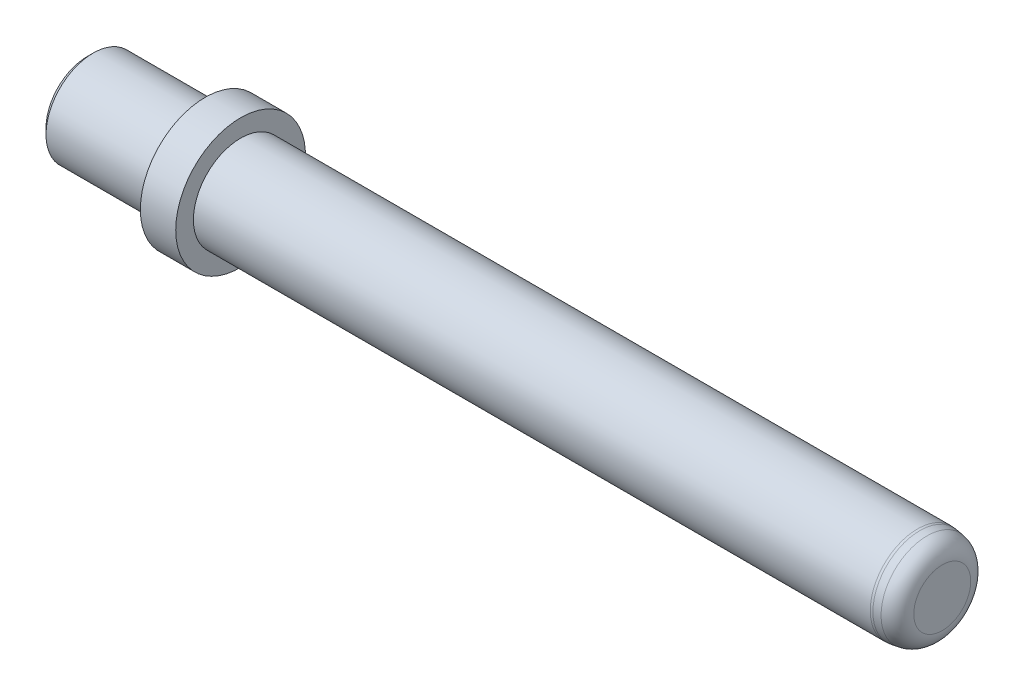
ISO-10303-21;
HEADER;
FILE_DESCRIPTION(('STEP AP214'),'2;1');
FILE_NAME('part.step','',(''),(''),'','','');
FILE_SCHEMA(('AUTOMOTIVE_DESIGN { 1 0 10303 214 1 1 1 1 }'));
ENDSEC;
DATA;
#1=APPLICATION_CONTEXT('core data for automotive mechanical design processes');
#2=APPLICATION_PROTOCOL_DEFINITION('international standard','automotive_design',2000,#1);
#3=PRODUCT_CONTEXT('',#1,'mechanical');
#4=PRODUCT('Part','Part','',(#3));
#5=PRODUCT_RELATED_PRODUCT_CATEGORY('part','',(#4));
#6=PRODUCT_DEFINITION_FORMATION('','',#4);
#7=PRODUCT_DEFINITION_CONTEXT('part definition',#1,'design');
#8=PRODUCT_DEFINITION('design','',#6,#7);
#9=PRODUCT_DEFINITION_SHAPE('','',#8);
#10=(LENGTH_UNIT() NAMED_UNIT(*) SI_UNIT(.MILLI.,.METRE.));
#11=(NAMED_UNIT(*) PLANE_ANGLE_UNIT() SI_UNIT($,.RADIAN.));
#12=(NAMED_UNIT(*) SI_UNIT($,.STERADIAN.) SOLID_ANGLE_UNIT());
#13=UNCERTAINTY_MEASURE_WITH_UNIT(LENGTH_MEASURE(1.E-05),#10,'distance_accuracy_value','');
#14=(GEOMETRIC_REPRESENTATION_CONTEXT(3) GLOBAL_UNCERTAINTY_ASSIGNED_CONTEXT((#13)) GLOBAL_UNIT_ASSIGNED_CONTEXT((#10,
#11,#12)) REPRESENTATION_CONTEXT('',''));
#15=CARTESIAN_POINT('',(0.,0.,0.));
#16=DIRECTION('',(0.,0.,1.));
#17=DIRECTION('',(1.,0.,0.));
#18=AXIS2_PLACEMENT_3D('',#15,#16,#17);
#19=CARTESIAN_POINT('',(4.,0.,0.));
#20=DIRECTION('',(-1.,0.,0.));
#21=DIRECTION('',(0.,0.,1.));
#22=AXIS2_PLACEMENT_3D('',#19,#20,#21);
#23=CONICAL_SURFACE('',#22,3.4,1.02974425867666);
#24=CARTESIAN_POINT('',(6.0429261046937,0.,0.));
#25=VERTEX_POINT('',#24);
#26=VERTEX_LOOP('',#25);
#27=FACE_BOUND('',#26,.T.);
#28=CARTESIAN_POINT('',(4.,0.,0.));
#29=DIRECTION('',(-1.,0.,0.));
#30=DIRECTION('',(0.,0.,1.));
#31=AXIS2_PLACEMENT_3D('',#28,#29,#30);
#32=CIRCLE('',#31,3.4);
#33=CARTESIAN_POINT('',(4.,0.,3.4));
#34=VERTEX_POINT('',#33);
#35=EDGE_CURVE('E11',#34,#34,#32,.T.);
#36=ORIENTED_EDGE('',*,*,#35,.T.);
#37=EDGE_LOOP('',(#36));
#38=FACE_BOUND('',#37,.T.);
#39=ADVANCED_FACE('F36',(#27,#38),#23,.F.);
#40=CARTESIAN_POINT('',(125.,0.,0.));
#41=DIRECTION('',(-1.,0.,0.));
#42=DIRECTION('',(0.,0.,1.));
#43=AXIS2_PLACEMENT_3D('',#40,#41,#42);
#44=CYLINDRICAL_SURFACE('',#43,3.4);
#45=ORIENTED_EDGE('',*,*,#35,.F.);
#46=EDGE_LOOP('',(#45));
#47=FACE_BOUND('',#46,.T.);
#48=CARTESIAN_POINT('',(0.,0.,0.));
#49=DIRECTION('',(-1.,0.,0.));
#50=DIRECTION('',(0.,0.,1.));
#51=AXIS2_PLACEMENT_3D('',#48,#49,#50);
#52=CIRCLE('',#51,3.4);
#53=CARTESIAN_POINT('',(0.,0.,3.4));
#54=VERTEX_POINT('',#53);
#55=EDGE_CURVE('E42',#54,#54,#52,.T.);
#56=ORIENTED_EDGE('',*,*,#55,.T.);
#57=EDGE_LOOP('',(#56));
#58=FACE_BOUND('',#57,.T.);
#59=ADVANCED_FACE('F47',(#47,#58),#44,.F.);
#60=CARTESIAN_POINT('',(0.,3.4,0.));
#61=DIRECTION('',(1.,0.,0.));
#62=DIRECTION('',(0.,0.,-1.));
#63=AXIS2_PLACEMENT_3D('',#60,#61,#62);
#64=PLANE('',#63);
#65=ORIENTED_EDGE('',*,*,#55,.F.);
#66=EDGE_LOOP('',(#65));
#67=FACE_BOUND('',#66,.T.);
#68=CARTESIAN_POINT('',(0.,0.,0.));
#69=DIRECTION('',(-1.,0.,0.));
#70=DIRECTION('',(0.,0.,1.));
#71=AXIS2_PLACEMENT_3D('',#68,#69,#70);
#72=CIRCLE('',#71,4.);
#73=CARTESIAN_POINT('',(0.,0.,4.));
#74=VERTEX_POINT('',#73);
#75=EDGE_CURVE('E56',#74,#74,#72,.T.);
#76=ORIENTED_EDGE('',*,*,#75,.T.);
#77=EDGE_LOOP('',(#76));
#78=FACE_BOUND('',#77,.T.);
#79=ADVANCED_FACE('F52',(#67,#78),#64,.F.);
#80=CARTESIAN_POINT('',(125.,0.,0.));
#81=DIRECTION('',(-1.,0.,0.));
#82=DIRECTION('',(0.,0.,1.));
#83=AXIS2_PLACEMENT_3D('',#80,#81,#82);
#84=CYLINDRICAL_SURFACE('',#83,4.);
#85=ORIENTED_EDGE('',*,*,#75,.F.);
#86=EDGE_LOOP('',(#85));
#87=FACE_BOUND('',#86,.T.);
#88=CARTESIAN_POINT('',(-20.,0.,0.));
#89=DIRECTION('',(-1.,0.,0.));
#90=DIRECTION('',(0.,0.,1.));
#91=AXIS2_PLACEMENT_3D('',#88,#89,#90);
#92=CIRCLE('',#91,4.);
#93=CARTESIAN_POINT('',(-20.,0.,4.));
#94=VERTEX_POINT('',#93);
#95=EDGE_CURVE('E58',#94,#94,#92,.T.);
#96=ORIENTED_EDGE('',*,*,#95,.T.);
#97=EDGE_LOOP('',(#96));
#98=FACE_BOUND('',#97,.T.);
#99=ADVANCED_FACE('F140',(#87,#98),#84,.F.);
#100=CARTESIAN_POINT('',(-20.,4.,0.));
#101=DIRECTION('',(1.,0.,0.));
#102=DIRECTION('',(0.,0.,-1.));
#103=AXIS2_PLACEMENT_3D('',#100,#101,#102);
#104=PLANE('',#103);
#105=ORIENTED_EDGE('',*,*,#95,.F.);
#106=EDGE_LOOP('',(#105));
#107=FACE_BOUND('',#106,.T.);
#108=CARTESIAN_POINT('',(-20.,0.,0.));
#109=DIRECTION('',(-1.,0.,0.));
#110=DIRECTION('',(0.,0.,1.));
#111=AXIS2_PLACEMENT_3D('',#108,#109,#110);
#112=CIRCLE('',#111,7.);
#113=CARTESIAN_POINT('',(-20.,0.,7.));
#114=VERTEX_POINT('',#113);
#115=EDGE_CURVE('E63',#114,#114,#112,.T.);
#116=ORIENTED_EDGE('',*,*,#115,.T.);
#117=EDGE_LOOP('',(#116));
#118=FACE_BOUND('',#117,.T.);
#119=ADVANCED_FACE('F136',(#107,#118),#104,.F.);
#120=CARTESIAN_POINT('',(-19.,0.,0.));
#121=DIRECTION('',(1.,0.,0.));
#122=DIRECTION('',(0.,0.,-1.));
#123=AXIS2_PLACEMENT_3D('',#120,#121,#122);
#124=CONICAL_SURFACE('',#123,8.,0.785398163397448);
#125=ORIENTED_EDGE('',*,*,#115,.F.);
#126=EDGE_LOOP('',(#125));
#127=FACE_BOUND('',#126,.T.);
#128=CARTESIAN_POINT('',(-19.,0.,0.));
#129=DIRECTION('',(-1.,0.,0.));
#130=DIRECTION('',(0.,0.,1.));
#131=AXIS2_PLACEMENT_3D('',#128,#129,#130);
#132=CIRCLE('',#131,8.);
#133=CARTESIAN_POINT('',(-19.,0.,8.));
#134=VERTEX_POINT('',#133);
#135=EDGE_CURVE('E66',#134,#134,#132,.T.);
#136=ORIENTED_EDGE('',*,*,#135,.T.);
#137=EDGE_LOOP('',(#136));
#138=FACE_BOUND('',#137,.T.);
#139=ADVANCED_FACE('F132',(#127,#138),#124,.T.);
#140=CARTESIAN_POINT('',(125.,0.,0.));
#141=DIRECTION('',(-1.,0.,0.));
#142=DIRECTION('',(0.,0.,1.));
#143=AXIS2_PLACEMENT_3D('',#140,#141,#142);
#144=CYLINDRICAL_SURFACE('',#143,8.);
#145=ORIENTED_EDGE('',*,*,#135,.F.);
#146=EDGE_LOOP('',(#145));
#147=FACE_BOUND('',#146,.T.);
#148=CARTESIAN_POINT('',(0.,0.,0.));
#149=DIRECTION('',(-1.,0.,0.));
#150=DIRECTION('',(0.,0.,1.));
#151=AXIS2_PLACEMENT_3D('',#148,#149,#150);
#152=CIRCLE('',#151,8.);
#153=CARTESIAN_POINT('',(0.,0.,8.));
#154=VERTEX_POINT('',#153);
#155=EDGE_CURVE('E69',#154,#154,#152,.T.);
#156=ORIENTED_EDGE('',*,*,#155,.T.);
#157=EDGE_LOOP('',(#156));
#158=FACE_BOUND('',#157,.T.);
#159=ADVANCED_FACE('F128',(#147,#158),#144,.T.);
#160=CARTESIAN_POINT('',(0.,8.,0.));
#161=DIRECTION('',(1.,0.,0.));
#162=DIRECTION('',(0.,0.,-1.));
#163=AXIS2_PLACEMENT_3D('',#160,#161,#162);
#164=PLANE('',#163);
#165=ORIENTED_EDGE('',*,*,#155,.F.);
#166=EDGE_LOOP('',(#165));
#167=FACE_BOUND('',#166,.T.);
#168=CARTESIAN_POINT('',(0.,0.,0.));
#169=DIRECTION('',(-1.,0.,0.));
#170=DIRECTION('',(0.,0.,1.));
#171=AXIS2_PLACEMENT_3D('',#168,#169,#170);
#172=CIRCLE('',#171,11.);
#173=CARTESIAN_POINT('',(0.,0.,11.));
#174=VERTEX_POINT('',#173);
#175=EDGE_CURVE('E72',#174,#174,#172,.T.);
#176=ORIENTED_EDGE('',*,*,#175,.T.);
#177=EDGE_LOOP('',(#176));
#178=FACE_BOUND('',#177,.T.);
#179=ADVANCED_FACE('F124',(#167,#178),#164,.F.);
#180=CARTESIAN_POINT('',(125.,0.,0.));
#181=DIRECTION('',(-1.,0.,0.));
#182=DIRECTION('',(0.,0.,1.));
#183=AXIS2_PLACEMENT_3D('',#180,#181,#182);
#184=CYLINDRICAL_SURFACE('',#183,11.);
#185=ORIENTED_EDGE('',*,*,#175,.F.);
#186=EDGE_LOOP('',(#185));
#187=FACE_BOUND('',#186,.T.);
#188=CARTESIAN_POINT('',(6.00000000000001,0.,0.));
#189=DIRECTION('',(-1.,0.,0.));
#190=DIRECTION('',(0.,0.,1.));
#191=AXIS2_PLACEMENT_3D('',#188,#189,#190);
#192=CIRCLE('',#191,11.);
#193=CARTESIAN_POINT('',(6.00000000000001,0.,11.));
#194=VERTEX_POINT('',#193);
#195=EDGE_CURVE('E75',#194,#194,#192,.T.);
#196=ORIENTED_EDGE('',*,*,#195,.T.);
#197=EDGE_LOOP('',(#196));
#198=FACE_BOUND('',#197,.T.);
#199=ADVANCED_FACE('F120',(#187,#198),#184,.T.);
#200=CARTESIAN_POINT('',(6.,11.,0.));
#201=DIRECTION('',(-1.,0.,0.));
#202=DIRECTION('',(0.,0.,1.));
#203=AXIS2_PLACEMENT_3D('',#200,#201,#202);
#204=PLANE('',#203);
#205=ORIENTED_EDGE('',*,*,#195,.F.);
#206=EDGE_LOOP('',(#205));
#207=FACE_BOUND('',#206,.T.);
#208=CARTESIAN_POINT('',(6.00000000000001,0.,0.));
#209=DIRECTION('',(-1.,0.,0.));
#210=DIRECTION('',(0.,0.,1.));
#211=AXIS2_PLACEMENT_3D('',#208,#209,#210);
#212=CIRCLE('',#211,8.);
#213=CARTESIAN_POINT('',(6.00000000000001,0.,8.));
#214=VERTEX_POINT('',#213);
#215=EDGE_CURVE('E78',#214,#214,#212,.T.);
#216=ORIENTED_EDGE('',*,*,#215,.T.);
#217=EDGE_LOOP('',(#216));
#218=FACE_BOUND('',#217,.T.);
#219=ADVANCED_FACE('F116',(#207,#218),#204,.F.);
#220=CARTESIAN_POINT('',(125.,0.,0.));
#221=DIRECTION('',(-1.,0.,0.));
#222=DIRECTION('',(0.,0.,1.));
#223=AXIS2_PLACEMENT_3D('',#220,#221,#222);
#224=CYLINDRICAL_SURFACE('',#223,8.);
#225=ORIENTED_EDGE('',*,*,#215,.F.);
#226=EDGE_LOOP('',(#225));
#227=FACE_BOUND('',#226,.T.);
#228=CARTESIAN_POINT('',(120.79021956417,0.,0.));
#229=DIRECTION('',(-1.,0.,0.));
#230=DIRECTION('',(0.,0.,1.));
#231=AXIS2_PLACEMENT_3D('',#228,#229,#230);
#232=CIRCLE('',#231,8.);
#233=CARTESIAN_POINT('',(120.79021956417,0.,8.));
#234=VERTEX_POINT('',#233);
#235=EDGE_CURVE('E81',#234,#234,#232,.T.);
#236=ORIENTED_EDGE('',*,*,#235,.T.);
#237=EDGE_LOOP('',(#236));
#238=FACE_BOUND('',#237,.T.);
#239=ADVANCED_FACE('F112',(#227,#238),#224,.T.);
#240=CARTESIAN_POINT('',(120.790219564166,0.,0.));
#241=DIRECTION('',(-1.,0.,0.));
#242=DIRECTION('',(0.,0.,1.));
#243=AXIS2_PLACEMENT_3D('',#240,#241,#242);
#244=TOROIDAL_SURFACE('',#243,4.99999999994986,3.00000000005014);
#245=ORIENTED_EDGE('',*,*,#235,.F.);
#246=EDGE_LOOP('',(#245));
#247=FACE_BOUND('',#246,.T.);
#248=CARTESIAN_POINT('',(121.20773886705,0.,0.));
#249=DIRECTION('',(-1.,0.,0.));
#250=DIRECTION('',(0.,0.,1.));
#251=AXIS2_PLACEMENT_3D('',#248,#249,#250);
#252=CIRCLE('',#251,7.9708042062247);
#253=CARTESIAN_POINT('',(121.20773886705,0.,7.9708042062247));
#254=VERTEX_POINT('',#253);
#255=EDGE_CURVE('E84',#254,#254,#252,.T.);
#256=ORIENTED_EDGE('',*,*,#255,.T.);
#257=EDGE_LOOP('',(#256));
#258=FACE_BOUND('',#257,.T.);
#259=ADVANCED_FACE('F108',(#247,#258),#244,.T.);
#260=CARTESIAN_POINT('',(122.41751930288,0.,0.));
#261=DIRECTION('',(-1.,0.,0.));
#262=DIRECTION('',(0.,0.,1.));
#263=AXIS2_PLACEMENT_3D('',#260,#261,#262);
#264=CONICAL_SURFACE('',#263,7.8007806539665,0.139626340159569);
#265=ORIENTED_EDGE('',*,*,#255,.F.);
#266=EDGE_LOOP('',(#265));
#267=FACE_BOUND('',#266,.T.);
#268=CARTESIAN_POINT('',(122.41751930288,0.,0.));
#269=DIRECTION('',(-1.,0.,0.));
#270=DIRECTION('',(0.,0.,1.));
#271=AXIS2_PLACEMENT_3D('',#268,#269,#270);
#272=CIRCLE('',#271,7.8007806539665);
#273=CARTESIAN_POINT('',(122.41751930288,0.,7.8007806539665));
#274=VERTEX_POINT('',#273);
#275=EDGE_CURVE('E87',#274,#274,#272,.T.);
#276=ORIENTED_EDGE('',*,*,#275,.T.);
#277=EDGE_LOOP('',(#276));
#278=FACE_BOUND('',#277,.T.);
#279=ADVANCED_FACE('F102',(#267,#278),#264,.T.);
#280=CARTESIAN_POINT('',(122.000000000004,0.,0.));
#281=DIRECTION('',(-1.,0.,0.));
#282=DIRECTION('',(0.,0.,1.));
#283=AXIS2_PLACEMENT_3D('',#280,#281,#282);
#284=TOROIDAL_SURFACE('',#283,4.82997644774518,2.99999999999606);
#285=ORIENTED_EDGE('',*,*,#275,.F.);
#286=EDGE_LOOP('',(#285));
#287=FACE_BOUND('',#286,.T.);
#288=CARTESIAN_POINT('',(125.,0.,0.));
#289=DIRECTION('',(-1.,0.,0.));
#290=DIRECTION('',(0.,0.,1.));
#291=AXIS2_PLACEMENT_3D('',#288,#289,#290);
#292=CIRCLE('',#291,4.8299764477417);
#293=CARTESIAN_POINT('',(125.,0.,4.8299764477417));
#294=VERTEX_POINT('',#293);
#295=EDGE_CURVE('E90',#294,#294,#292,.T.);
#296=ORIENTED_EDGE('',*,*,#295,.T.);
#297=EDGE_LOOP('',(#296));
#298=FACE_BOUND('',#297,.T.);
#299=ADVANCED_FACE('F94',(#287,#298),#284,.T.);
#300=CARTESIAN_POINT('',(125.,4.8299764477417,0.));
#301=DIRECTION('',(-1.,0.,0.));
#302=DIRECTION('',(0.,0.,1.));
#303=AXIS2_PLACEMENT_3D('',#300,#301,#302);
#304=PLANE('',#303);
#305=ORIENTED_EDGE('',*,*,#295,.F.);
#306=EDGE_LOOP('',(#305));
#307=FACE_BOUND('',#306,.T.);
#308=ADVANCED_FACE('F96',(#307),#304,.F.);
#309=CLOSED_SHELL('',(#39,#59,#79,#99,#119,#139,#159,#179,#199,#219,#239,#259,#279,#299,#308));
#310=MANIFOLD_SOLID_BREP('B2',#309);
#311=ADVANCED_BREP_SHAPE_REPRESENTATION('',(#18,#310),#14);
#312=SHAPE_DEFINITION_REPRESENTATION(#9,#311);
ENDSEC;
END-ISO-10303-21;
